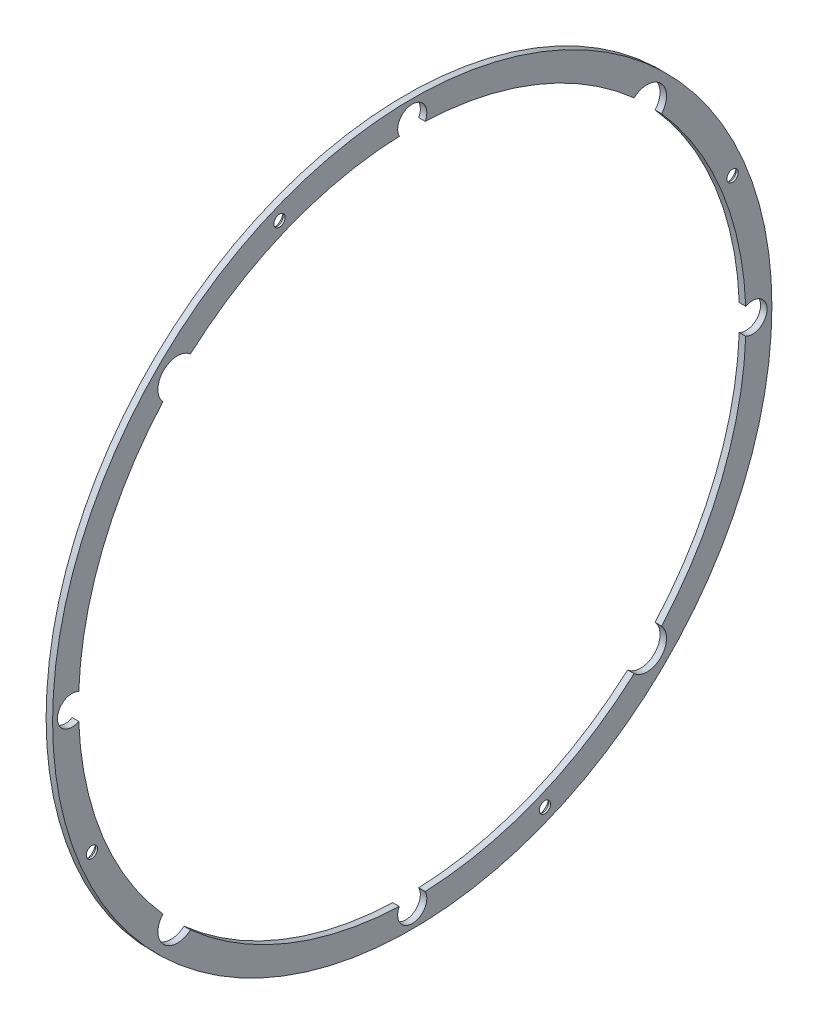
ISO-10303-21;
HEADER;
FILE_DESCRIPTION(('STEP AP214'),'2;1');
FILE_NAME('part.step','',(''),(''),'','','');
FILE_SCHEMA(('AUTOMOTIVE_DESIGN { 1 0 10303 214 1 1 1 1 }'));
ENDSEC;
DATA;
#1=APPLICATION_CONTEXT('core data for automotive mechanical design processes');
#2=APPLICATION_PROTOCOL_DEFINITION('international standard','automotive_design',2000,#1);
#3=PRODUCT_CONTEXT('',#1,'mechanical');
#4=PRODUCT('Part','Part','',(#3));
#5=PRODUCT_RELATED_PRODUCT_CATEGORY('part','',(#4));
#6=PRODUCT_DEFINITION_FORMATION('','',#4);
#7=PRODUCT_DEFINITION_CONTEXT('part definition',#1,'design');
#8=PRODUCT_DEFINITION('design','',#6,#7);
#9=PRODUCT_DEFINITION_SHAPE('','',#8);
#10=(LENGTH_UNIT() NAMED_UNIT(*) SI_UNIT(.MILLI.,.METRE.));
#11=(NAMED_UNIT(*) PLANE_ANGLE_UNIT() SI_UNIT($,.RADIAN.));
#12=(NAMED_UNIT(*) SI_UNIT($,.STERADIAN.) SOLID_ANGLE_UNIT());
#13=UNCERTAINTY_MEASURE_WITH_UNIT(LENGTH_MEASURE(1.E-05),#10,'distance_accuracy_value','');
#14=(GEOMETRIC_REPRESENTATION_CONTEXT(3) GLOBAL_UNCERTAINTY_ASSIGNED_CONTEXT((#13)) GLOBAL_UNIT_ASSIGNED_CONTEXT((#10,
#11,#12)) REPRESENTATION_CONTEXT('',''));
#15=CARTESIAN_POINT('',(0.,0.,0.));
#16=DIRECTION('',(0.,0.,1.));
#17=DIRECTION('',(1.,0.,0.));
#18=AXIS2_PLACEMENT_3D('',#15,#16,#17);
#19=CARTESIAN_POINT('',(0.,0.,0.));
#20=DIRECTION('',(1.,0.,0.));
#21=DIRECTION('',(0.,0.,-1.));
#22=AXIS2_PLACEMENT_3D('',#19,#20,#21);
#23=PLANE('',#22);
#24=CARTESIAN_POINT('',(0.,40.9471272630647,-98.8551099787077));
#25=DIRECTION('',(-1.,0.,0.));
#26=DIRECTION('',(0.,0.,1.));
#27=AXIS2_PLACEMENT_3D('',#24,#25,#26);
#28=CIRCLE('',#27,3.1);
#29=CARTESIAN_POINT('',(0.,40.9471272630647,-95.7551099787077));
#30=VERTEX_POINT('',#29);
#31=EDGE_CURVE('E289',#30,#30,#28,.T.);
#32=ORIENTED_EDGE('',*,*,#31,.F.);
#33=EDGE_LOOP('',(#32));
#34=FACE_BOUND('',#33,.T.);
#35=CARTESIAN_POINT('',(0.,0.,0.));
#36=DIRECTION('',(1.,0.,0.));
#37=DIRECTION('',(0.,0.,-1.));
#38=AXIS2_PLACEMENT_3D('',#35,#36,#37);
#39=CIRCLE('',#38,103.);
#40=CARTESIAN_POINT('',(0.,-102.922619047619,-3.99180264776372));
#41=VERTEX_POINT('',#40);
#42=CARTESIAN_POINT('',(0.,-76.9450746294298,-68.4722972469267));
#43=VERTEX_POINT('',#42);
#44=EDGE_CURVE('E186',#41,#43,#39,.T.);
#45=ORIENTED_EDGE('',*,*,#44,.T.);
#46=CARTESIAN_POINT('',(0.,-72.4784450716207,-72.4784450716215));
#47=DIRECTION('',(-1.,0.,0.));
#48=DIRECTION('',(0.,1.,0.));
#49=AXIS2_PLACEMENT_3D('',#46,#47,#48);
#50=CIRCLE('',#49,6.);
#51=CARTESIAN_POINT('',(0.,-68.4722972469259,-76.9450746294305));
#52=VERTEX_POINT('',#51);
#53=EDGE_CURVE('E154',#52,#43,#50,.T.);
#54=ORIENTED_EDGE('',*,*,#53,.F.);
#55=CARTESIAN_POINT('',(0.,-3.99180264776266,-102.922619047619));
#56=VERTEX_POINT('',#55);
#57=EDGE_CURVE('E162',#52,#56,#39,.T.);
#58=ORIENTED_EDGE('',*,*,#57,.T.);
#59=CARTESIAN_POINT('',(0.,0.,-105.));
#60=DIRECTION('',(-1.,0.,0.));
#61=DIRECTION('',(0.,0.,1.));
#62=AXIS2_PLACEMENT_3D('',#59,#60,#61);
#63=CIRCLE('',#62,4.5);
#64=CARTESIAN_POINT('',(0.,3.99180264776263,-102.922619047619));
#65=VERTEX_POINT('',#64);
#66=EDGE_CURVE('E176',#65,#56,#63,.T.);
#67=ORIENTED_EDGE('',*,*,#66,.F.);
#68=CARTESIAN_POINT('',(0.,68.4722972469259,-76.9450746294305));
#69=VERTEX_POINT('',#68);
#70=EDGE_CURVE('E188',#65,#69,#39,.T.);
#71=ORIENTED_EDGE('',*,*,#70,.T.);
#72=CARTESIAN_POINT('',(0.,72.4784450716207,-72.4784450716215));
#73=DIRECTION('',(-1.,0.,0.));
#74=DIRECTION('',(0.,0.,1.));
#75=AXIS2_PLACEMENT_3D('',#72,#73,#74);
#76=CIRCLE('',#75,6.);
#77=CARTESIAN_POINT('',(0.,76.9450746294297,-68.4722972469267));
#78=VERTEX_POINT('',#77);
#79=EDGE_CURVE('E226',#78,#69,#76,.T.);
#80=ORIENTED_EDGE('',*,*,#79,.F.);
#81=CARTESIAN_POINT('',(0.,102.922619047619,-3.9918026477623));
#82=VERTEX_POINT('',#81);
#83=EDGE_CURVE('E259',#78,#82,#39,.T.);
#84=ORIENTED_EDGE('',*,*,#83,.T.);
#85=CARTESIAN_POINT('',(0.,105.,3.53746749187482E-13));
#86=DIRECTION('',(-1.,0.,0.));
#87=DIRECTION('',(0.,-1.,0.));
#88=AXIS2_PLACEMENT_3D('',#85,#86,#87);
#89=CIRCLE('',#88,4.5);
#90=CARTESIAN_POINT('',(0.,102.922619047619,3.99180264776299));
#91=VERTEX_POINT('',#90);
#92=EDGE_CURVE('E250',#91,#82,#89,.T.);
#93=ORIENTED_EDGE('',*,*,#92,.F.);
#94=CARTESIAN_POINT('',(0.,76.9450746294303,68.4722972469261));
#95=VERTEX_POINT('',#94);
#96=EDGE_CURVE('E260',#91,#95,#39,.T.);
#97=ORIENTED_EDGE('',*,*,#96,.T.);
#98=CARTESIAN_POINT('',(0.,72.4784450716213,72.478445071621));
#99=DIRECTION('',(-1.,0.,0.));
#100=DIRECTION('',(0.,-1.,0.));
#101=AXIS2_PLACEMENT_3D('',#98,#99,#100);
#102=CIRCLE('',#101,6.);
#103=CARTESIAN_POINT('',(0.,68.4722972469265,76.94507462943));
#104=VERTEX_POINT('',#103);
#105=EDGE_CURVE('E216',#104,#95,#102,.T.);
#106=ORIENTED_EDGE('',*,*,#105,.F.);
#107=CARTESIAN_POINT('',(0.,3.99180264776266,102.922619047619));
#108=VERTEX_POINT('',#107);
#109=EDGE_CURVE('E267',#104,#108,#39,.T.);
#110=ORIENTED_EDGE('',*,*,#109,.T.);
#111=CARTESIAN_POINT('',(0.,0.,105.));
#112=DIRECTION('',(-1.,0.,0.));
#113=DIRECTION('',(0.,0.,-1.));
#114=AXIS2_PLACEMENT_3D('',#111,#112,#113);
#115=CIRCLE('',#114,4.5);
#116=CARTESIAN_POINT('',(0.,-3.99180264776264,102.922619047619));
#117=VERTEX_POINT('',#116);
#118=EDGE_CURVE('E242',#117,#108,#115,.T.);
#119=ORIENTED_EDGE('',*,*,#118,.F.);
#120=CARTESIAN_POINT('',(0.,-68.4722972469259,76.9450746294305));
#121=VERTEX_POINT('',#120);
#122=EDGE_CURVE('E269',#117,#121,#39,.T.);
#123=ORIENTED_EDGE('',*,*,#122,.T.);
#124=CARTESIAN_POINT('',(0.,-72.4784450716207,72.4784450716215));
#125=DIRECTION('',(-1.,0.,0.));
#126=DIRECTION('',(0.,0.,-1.));
#127=AXIS2_PLACEMENT_3D('',#124,#125,#126);
#128=CIRCLE('',#127,6.);
#129=CARTESIAN_POINT('',(0.,-76.9450746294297,68.4722972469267));
#130=VERTEX_POINT('',#129);
#131=EDGE_CURVE('E163',#130,#121,#128,.T.);
#132=ORIENTED_EDGE('',*,*,#131,.F.);
#133=CARTESIAN_POINT('',(0.,-102.922619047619,3.99180264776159));
#134=VERTEX_POINT('',#133);
#135=EDGE_CURVE('E187',#130,#134,#39,.T.);
#136=ORIENTED_EDGE('',*,*,#135,.T.);
#137=CARTESIAN_POINT('',(0.,-105.,-1.08695783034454E-12));
#138=DIRECTION('',(-1.,0.,0.));
#139=DIRECTION('',(0.,1.,0.));
#140=AXIS2_PLACEMENT_3D('',#137,#138,#139);
#141=CIRCLE('',#140,4.5);
#142=EDGE_CURVE('E230',#41,#134,#141,.T.);
#143=ORIENTED_EDGE('',*,*,#142,.F.);
#144=EDGE_LOOP('',(#45,#54,#58,#67,#71,#80,#84,#93,#97,#106,#110,#119,#123,#132,#136,#143));
#145=FACE_BOUND('',#144,.T.);
#146=CARTESIAN_POINT('',(0.,0.,0.));
#147=DIRECTION('',(-1.,0.,0.));
#148=DIRECTION('',(0.,0.,1.));
#149=AXIS2_PLACEMENT_3D('',#146,#147,#148);
#150=CIRCLE('',#149,111.);
#151=CARTESIAN_POINT('',(0.,0.,111.));
#152=VERTEX_POINT('',#151);
#153=EDGE_CURVE('E266',#152,#152,#150,.T.);
#154=ORIENTED_EDGE('',*,*,#153,.T.);
#155=EDGE_LOOP('',(#154));
#156=FACE_BOUND('',#155,.T.);
#157=CARTESIAN_POINT('',(0.,98.8551099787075,40.947127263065));
#158=DIRECTION('',(-1.,0.,0.));
#159=DIRECTION('',(0.,0.,1.));
#160=AXIS2_PLACEMENT_3D('',#157,#158,#159);
#161=CIRCLE('',#160,3.10000000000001);
#162=CARTESIAN_POINT('',(0.,98.8551099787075,44.047127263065));
#163=VERTEX_POINT('',#162);
#164=EDGE_CURVE('E298',#163,#163,#161,.T.);
#165=ORIENTED_EDGE('',*,*,#164,.F.);
#166=EDGE_LOOP('',(#165));
#167=FACE_BOUND('',#166,.T.);
#168=CARTESIAN_POINT('',(0.,-40.9471272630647,98.8551099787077));
#169=DIRECTION('',(-1.,0.,0.));
#170=DIRECTION('',(0.,0.,1.));
#171=AXIS2_PLACEMENT_3D('',#168,#169,#170);
#172=CIRCLE('',#171,3.1);
#173=CARTESIAN_POINT('',(0.,-40.9471272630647,101.955109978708));
#174=VERTEX_POINT('',#173);
#175=EDGE_CURVE('E307',#174,#174,#172,.T.);
#176=ORIENTED_EDGE('',*,*,#175,.F.);
#177=EDGE_LOOP('',(#176));
#178=FACE_BOUND('',#177,.T.);
#179=CARTESIAN_POINT('',(0.,-98.8551099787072,-40.9471272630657));
#180=DIRECTION('',(-1.,0.,0.));
#181=DIRECTION('',(0.,0.,1.));
#182=AXIS2_PLACEMENT_3D('',#179,#180,#181);
#183=CIRCLE('',#182,3.10000000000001);
#184=CARTESIAN_POINT('',(0.,-98.8551099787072,-37.8471272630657));
#185=VERTEX_POINT('',#184);
#186=EDGE_CURVE('E316',#185,#185,#183,.T.);
#187=ORIENTED_EDGE('',*,*,#186,.F.);
#188=EDGE_LOOP('',(#187));
#189=FACE_BOUND('',#188,.T.);
#190=ADVANCED_FACE('F36',(#34,#145,#156,#167,#178,#189),#23,.F.);
#191=CARTESIAN_POINT('',(0.,0.,0.));
#192=DIRECTION('',(1.,0.,0.));
#193=DIRECTION('',(0.,0.,-1.));
#194=AXIS2_PLACEMENT_3D('',#191,#192,#193);
#195=CYLINDRICAL_SURFACE('',#194,103.);
#196=ORIENTED_EDGE('',*,*,#57,.F.);
#197=DIRECTION('',(-1.,0.,0.));
#198=VECTOR('',#197,1.);
#199=CARTESIAN_POINT('',(1.,-68.4722972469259,-76.9450746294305));
#200=LINE('',#199,#198);
#201=CARTESIAN_POINT('',(2.00000000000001,-68.4722972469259,-76.9450746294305));
#202=VERTEX_POINT('',#201);
#203=EDGE_CURVE('E148',#52,#202,#200,.F.);
#204=ORIENTED_EDGE('',*,*,#203,.T.);
#205=CARTESIAN_POINT('',(2.00000000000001,0.,0.));
#206=DIRECTION('',(1.,0.,0.));
#207=DIRECTION('',(0.,0.,-1.));
#208=AXIS2_PLACEMENT_3D('',#205,#206,#207);
#209=CIRCLE('',#208,103.);
#210=CARTESIAN_POINT('',(2.00000000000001,-3.99180264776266,-102.922619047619));
#211=VERTEX_POINT('',#210);
#212=EDGE_CURVE('E160',#202,#211,#209,.T.);
#213=ORIENTED_EDGE('',*,*,#212,.T.);
#214=DIRECTION('',(-1.,0.,0.));
#215=VECTOR('',#214,1.);
#216=CARTESIAN_POINT('',(1.,-3.99180264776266,-102.922619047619));
#217=LINE('',#216,#215);
#218=EDGE_CURVE('E394',#211,#56,#217,.T.);
#219=ORIENTED_EDGE('',*,*,#218,.T.);
#220=EDGE_LOOP('',(#196,#204,#213,#219));
#221=FACE_BOUND('',#220,.T.);
#222=ADVANCED_FACE('F158',(#221),#195,.F.);
#223=ORIENTED_EDGE('',*,*,#135,.F.);
#224=DIRECTION('',(-1.,0.,0.));
#225=VECTOR('',#224,1.);
#226=CARTESIAN_POINT('',(1.,-76.9450746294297,68.4722972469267));
#227=LINE('',#226,#225);
#228=CARTESIAN_POINT('',(2.00000000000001,-76.9450746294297,68.4722972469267));
#229=VERTEX_POINT('',#228);
#230=EDGE_CURVE('E210',#130,#229,#227,.F.);
#231=ORIENTED_EDGE('',*,*,#230,.T.);
#232=CARTESIAN_POINT('',(2.00000000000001,-102.922619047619,3.99180264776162));
#233=VERTEX_POINT('',#232);
#234=EDGE_CURVE('E172',#229,#233,#209,.T.);
#235=ORIENTED_EDGE('',*,*,#234,.T.);
#236=DIRECTION('',(-1.,0.,0.));
#237=VECTOR('',#236,1.);
#238=CARTESIAN_POINT('',(1.,-102.922619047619,3.99180264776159));
#239=LINE('',#238,#237);
#240=EDGE_CURVE('E234',#233,#134,#239,.T.);
#241=ORIENTED_EDGE('',*,*,#240,.T.);
#242=EDGE_LOOP('',(#223,#231,#235,#241));
#243=FACE_BOUND('',#242,.T.);
#244=ADVANCED_FACE('F329',(#243),#195,.F.);
#245=ORIENTED_EDGE('',*,*,#109,.F.);
#246=DIRECTION('',(-1.,0.,0.));
#247=VECTOR('',#246,1.);
#248=CARTESIAN_POINT('',(1.,68.4722972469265,76.94507462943));
#249=LINE('',#248,#247);
#250=CARTESIAN_POINT('',(2.00000000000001,68.4722972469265,76.94507462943));
#251=VERTEX_POINT('',#250);
#252=EDGE_CURVE('E223',#104,#251,#249,.F.);
#253=ORIENTED_EDGE('',*,*,#252,.T.);
#254=CARTESIAN_POINT('',(2.00000000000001,3.99180264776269,102.922619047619));
#255=VERTEX_POINT('',#254);
#256=EDGE_CURVE('E180',#251,#255,#209,.T.);
#257=ORIENTED_EDGE('',*,*,#256,.T.);
#258=DIRECTION('',(-1.,0.,0.));
#259=VECTOR('',#258,1.);
#260=CARTESIAN_POINT('',(1.,3.99180264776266,102.922619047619));
#261=LINE('',#260,#259);
#262=EDGE_CURVE('E244',#255,#108,#261,.T.);
#263=ORIENTED_EDGE('',*,*,#262,.T.);
#264=EDGE_LOOP('',(#245,#253,#257,#263));
#265=FACE_BOUND('',#264,.T.);
#266=ADVANCED_FACE('F412',(#265),#195,.F.);
#267=ORIENTED_EDGE('',*,*,#83,.F.);
#268=DIRECTION('',(-1.,0.,0.));
#269=VECTOR('',#268,1.);
#270=CARTESIAN_POINT('',(1.,76.9450746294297,-68.4722972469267));
#271=LINE('',#270,#269);
#272=CARTESIAN_POINT('',(2.00000000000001,76.9450746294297,-68.4722972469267));
#273=VERTEX_POINT('',#272);
#274=EDGE_CURVE('E11',#78,#273,#271,.F.);
#275=ORIENTED_EDGE('',*,*,#274,.T.);
#276=CARTESIAN_POINT('',(2.00000000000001,102.922619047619,-3.9918026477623));
#277=VERTEX_POINT('',#276);
#278=EDGE_CURVE('E175',#273,#277,#209,.T.);
#279=ORIENTED_EDGE('',*,*,#278,.T.);
#280=DIRECTION('',(-1.,0.,0.));
#281=VECTOR('',#280,1.);
#282=CARTESIAN_POINT('',(1.,102.922619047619,-3.9918026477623));
#283=LINE('',#282,#281);
#284=EDGE_CURVE('E400',#277,#82,#283,.T.);
#285=ORIENTED_EDGE('',*,*,#284,.T.);
#286=EDGE_LOOP('',(#267,#275,#279,#285));
#287=FACE_BOUND('',#286,.T.);
#288=ADVANCED_FACE('F408',(#287),#195,.F.);
#289=CARTESIAN_POINT('',(2.00000000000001,-102.922619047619,-3.99180264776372));
#290=VERTEX_POINT('',#289);
#291=CARTESIAN_POINT('',(2.00000000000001,-76.9450746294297,-68.4722972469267));
#292=VERTEX_POINT('',#291);
#293=EDGE_CURVE('E170',#290,#292,#209,.T.);
#294=ORIENTED_EDGE('',*,*,#293,.T.);
#295=DIRECTION('',(-1.,0.,0.));
#296=VECTOR('',#295,1.);
#297=CARTESIAN_POINT('',(1.,-76.9450746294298,-68.4722972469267));
#298=LINE('',#297,#296);
#299=EDGE_CURVE('E50',#292,#43,#298,.T.);
#300=ORIENTED_EDGE('',*,*,#299,.T.);
#301=ORIENTED_EDGE('',*,*,#44,.F.);
#302=DIRECTION('',(-1.,0.,0.));
#303=VECTOR('',#302,1.);
#304=CARTESIAN_POINT('',(1.,-102.922619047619,-3.99180264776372));
#305=LINE('',#304,#303);
#306=EDGE_CURVE('E239',#41,#290,#305,.F.);
#307=ORIENTED_EDGE('',*,*,#306,.T.);
#308=EDGE_LOOP('',(#294,#300,#301,#307));
#309=FACE_BOUND('',#308,.T.);
#310=ADVANCED_FACE('F280',(#309),#195,.F.);
#311=CARTESIAN_POINT('',(2.00000000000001,-3.99180264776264,102.922619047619));
#312=VERTEX_POINT('',#311);
#313=CARTESIAN_POINT('',(2.00000000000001,-68.4722972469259,76.9450746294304));
#314=VERTEX_POINT('',#313);
#315=EDGE_CURVE('E174',#312,#314,#209,.T.);
#316=ORIENTED_EDGE('',*,*,#315,.T.);
#317=DIRECTION('',(-1.,0.,0.));
#318=VECTOR('',#317,1.);
#319=CARTESIAN_POINT('',(1.,-68.4722972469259,76.9450746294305));
#320=LINE('',#319,#318);
#321=EDGE_CURVE('E58',#314,#121,#320,.T.);
#322=ORIENTED_EDGE('',*,*,#321,.T.);
#323=ORIENTED_EDGE('',*,*,#122,.F.);
#324=DIRECTION('',(-1.,0.,0.));
#325=VECTOR('',#324,1.);
#326=CARTESIAN_POINT('',(1.,-3.99180264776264,102.922619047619));
#327=LINE('',#326,#325);
#328=EDGE_CURVE('E201',#117,#312,#327,.F.);
#329=ORIENTED_EDGE('',*,*,#328,.T.);
#330=EDGE_LOOP('',(#316,#322,#323,#329));
#331=FACE_BOUND('',#330,.T.);
#332=ADVANCED_FACE('F198',(#331),#195,.F.);
#333=CARTESIAN_POINT('',(2.00000000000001,102.922619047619,3.99180264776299));
#334=VERTEX_POINT('',#333);
#335=CARTESIAN_POINT('',(2.00000000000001,76.9450746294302,68.4722972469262));
#336=VERTEX_POINT('',#335);
#337=EDGE_CURVE('E182',#334,#336,#209,.T.);
#338=ORIENTED_EDGE('',*,*,#337,.T.);
#339=DIRECTION('',(-1.,0.,0.));
#340=VECTOR('',#339,1.);
#341=CARTESIAN_POINT('',(1.,76.9450746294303,68.4722972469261));
#342=LINE('',#341,#340);
#343=EDGE_CURVE('E220',#336,#95,#342,.T.);
#344=ORIENTED_EDGE('',*,*,#343,.T.);
#345=ORIENTED_EDGE('',*,*,#96,.F.);
#346=DIRECTION('',(-1.,0.,0.));
#347=VECTOR('',#346,1.);
#348=CARTESIAN_POINT('',(1.,102.922619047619,3.991802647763));
#349=LINE('',#348,#347);
#350=EDGE_CURVE('E403',#91,#334,#349,.F.);
#351=ORIENTED_EDGE('',*,*,#350,.T.);
#352=EDGE_LOOP('',(#338,#344,#345,#351));
#353=FACE_BOUND('',#352,.T.);
#354=ADVANCED_FACE('F381',(#353),#195,.F.);
#355=CARTESIAN_POINT('',(0.,0.,0.));
#356=DIRECTION('',(-1.,0.,0.));
#357=DIRECTION('',(0.,0.,1.));
#358=AXIS2_PLACEMENT_3D('',#355,#356,#357);
#359=CYLINDRICAL_SURFACE('',#358,111.);
#360=ORIENTED_EDGE('',*,*,#153,.F.);
#361=EDGE_LOOP('',(#360));
#362=FACE_BOUND('',#361,.T.);
#363=CARTESIAN_POINT('',(2.,0.,0.));
#364=DIRECTION('',(-1.,0.,0.));
#365=DIRECTION('',(0.,0.,1.));
#366=AXIS2_PLACEMENT_3D('',#363,#364,#365);
#367=CIRCLE('',#366,111.);
#368=CARTESIAN_POINT('',(2.,0.,111.));
#369=VERTEX_POINT('',#368);
#370=EDGE_CURVE('E258',#369,#369,#367,.T.);
#371=ORIENTED_EDGE('',*,*,#370,.T.);
#372=EDGE_LOOP('',(#371));
#373=FACE_BOUND('',#372,.T.);
#374=ADVANCED_FACE('F382',(#362,#373),#359,.T.);
#375=CARTESIAN_POINT('',(2.00000000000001,111.,0.));
#376=DIRECTION('',(-1.,0.,0.));
#377=DIRECTION('',(0.,0.,1.));
#378=AXIS2_PLACEMENT_3D('',#375,#376,#377);
#379=PLANE('',#378);
#380=CARTESIAN_POINT('',(2.00000000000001,-98.8551099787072,-40.9471272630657));
#381=DIRECTION('',(-1.,0.,0.));
#382=DIRECTION('',(0.,0.,1.));
#383=AXIS2_PLACEMENT_3D('',#380,#381,#382);
#384=CIRCLE('',#383,1.75);
#385=CARTESIAN_POINT('',(2.00000000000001,-98.8551099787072,-39.1971272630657));
#386=VERTEX_POINT('',#385);
#387=EDGE_CURVE('E310',#386,#386,#384,.T.);
#388=ORIENTED_EDGE('',*,*,#387,.T.);
#389=EDGE_LOOP('',(#388));
#390=FACE_BOUND('',#389,.T.);
#391=CARTESIAN_POINT('',(2.00000000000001,-40.9471272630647,98.8551099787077));
#392=DIRECTION('',(-1.,0.,0.));
#393=DIRECTION('',(0.,0.,1.));
#394=AXIS2_PLACEMENT_3D('',#391,#392,#393);
#395=CIRCLE('',#394,1.75);
#396=CARTESIAN_POINT('',(2.00000000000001,-40.9471272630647,100.605109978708));
#397=VERTEX_POINT('',#396);
#398=EDGE_CURVE('E301',#397,#397,#395,.T.);
#399=ORIENTED_EDGE('',*,*,#398,.T.);
#400=EDGE_LOOP('',(#399));
#401=FACE_BOUND('',#400,.T.);
#402=CARTESIAN_POINT('',(2.00000000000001,98.8551099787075,40.947127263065));
#403=DIRECTION('',(-1.,0.,0.));
#404=DIRECTION('',(0.,0.,1.));
#405=AXIS2_PLACEMENT_3D('',#402,#403,#404);
#406=CIRCLE('',#405,1.75);
#407=CARTESIAN_POINT('',(2.00000000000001,98.8551099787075,42.697127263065));
#408=VERTEX_POINT('',#407);
#409=EDGE_CURVE('E292',#408,#408,#406,.T.);
#410=ORIENTED_EDGE('',*,*,#409,.T.);
#411=EDGE_LOOP('',(#410));
#412=FACE_BOUND('',#411,.T.);
#413=CARTESIAN_POINT('',(2.00000000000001,40.9471272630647,-98.8551099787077));
#414=DIRECTION('',(-1.,0.,0.));
#415=DIRECTION('',(0.,0.,1.));
#416=AXIS2_PLACEMENT_3D('',#413,#414,#415);
#417=CIRCLE('',#416,1.75);
#418=CARTESIAN_POINT('',(2.00000000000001,40.9471272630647,-97.1051099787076));
#419=VERTEX_POINT('',#418);
#420=EDGE_CURVE('E282',#419,#419,#417,.T.);
#421=ORIENTED_EDGE('',*,*,#420,.T.);
#422=EDGE_LOOP('',(#421));
#423=FACE_BOUND('',#422,.T.);
#424=ORIENTED_EDGE('',*,*,#212,.F.);
#425=CARTESIAN_POINT('',(2.00000000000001,-72.4784450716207,-72.4784450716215));
#426=DIRECTION('',(-1.,0.,0.));
#427=DIRECTION('',(0.,1.,0.));
#428=AXIS2_PLACEMENT_3D('',#425,#426,#427);
#429=CIRCLE('',#428,6.);
#430=EDGE_CURVE('E145',#202,#292,#429,.T.);
#431=ORIENTED_EDGE('',*,*,#430,.T.);
#432=ORIENTED_EDGE('',*,*,#293,.F.);
#433=CARTESIAN_POINT('',(2.00000000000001,-105.,-1.08695783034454E-12));
#434=DIRECTION('',(-1.,0.,0.));
#435=DIRECTION('',(0.,1.,0.));
#436=AXIS2_PLACEMENT_3D('',#433,#434,#435);
#437=CIRCLE('',#436,4.5);
#438=EDGE_CURVE('E232',#290,#233,#437,.T.);
#439=ORIENTED_EDGE('',*,*,#438,.T.);
#440=ORIENTED_EDGE('',*,*,#234,.F.);
#441=CARTESIAN_POINT('',(2.00000000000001,-72.4784450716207,72.4784450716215));
#442=DIRECTION('',(-1.,0.,0.));
#443=DIRECTION('',(0.,0.,-1.));
#444=AXIS2_PLACEMENT_3D('',#441,#442,#443);
#445=CIRCLE('',#444,6.);
#446=EDGE_CURVE('E206',#229,#314,#445,.T.);
#447=ORIENTED_EDGE('',*,*,#446,.T.);
#448=ORIENTED_EDGE('',*,*,#315,.F.);
#449=CARTESIAN_POINT('',(2.00000000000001,0.,105.));
#450=DIRECTION('',(-1.,0.,0.));
#451=DIRECTION('',(0.,0.,-1.));
#452=AXIS2_PLACEMENT_3D('',#449,#450,#451);
#453=CIRCLE('',#452,4.5);
#454=EDGE_CURVE('E204',#312,#255,#453,.T.);
#455=ORIENTED_EDGE('',*,*,#454,.T.);
#456=ORIENTED_EDGE('',*,*,#256,.F.);
#457=CARTESIAN_POINT('',(2.00000000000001,72.4784450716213,72.478445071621));
#458=DIRECTION('',(-1.,0.,0.));
#459=DIRECTION('',(0.,-1.,0.));
#460=AXIS2_PLACEMENT_3D('',#457,#458,#459);
#461=CIRCLE('',#460,6.);
#462=EDGE_CURVE('E217',#251,#336,#461,.T.);
#463=ORIENTED_EDGE('',*,*,#462,.T.);
#464=ORIENTED_EDGE('',*,*,#337,.F.);
#465=CARTESIAN_POINT('',(2.00000000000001,105.,3.53746749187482E-13));
#466=DIRECTION('',(-1.,0.,0.));
#467=DIRECTION('',(0.,-1.,0.));
#468=AXIS2_PLACEMENT_3D('',#465,#466,#467);
#469=CIRCLE('',#468,4.5);
#470=EDGE_CURVE('E251',#334,#277,#469,.T.);
#471=ORIENTED_EDGE('',*,*,#470,.T.);
#472=ORIENTED_EDGE('',*,*,#278,.F.);
#473=CARTESIAN_POINT('',(2.00000000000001,72.4784450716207,-72.4784450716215));
#474=DIRECTION('',(-1.,0.,0.));
#475=DIRECTION('',(0.,0.,1.));
#476=AXIS2_PLACEMENT_3D('',#473,#474,#475);
#477=CIRCLE('',#476,6.);
#478=CARTESIAN_POINT('',(2.00000000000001,68.4722972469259,-76.9450746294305));
#479=VERTEX_POINT('',#478);
#480=EDGE_CURVE('E227',#273,#479,#477,.T.);
#481=ORIENTED_EDGE('',*,*,#480,.T.);
#482=CARTESIAN_POINT('',(2.00000000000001,3.99180264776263,-102.922619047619));
#483=VERTEX_POINT('',#482);
#484=EDGE_CURVE('E173',#483,#479,#209,.T.);
#485=ORIENTED_EDGE('',*,*,#484,.F.);
#486=CARTESIAN_POINT('',(2.00000000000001,0.,-105.));
#487=DIRECTION('',(-1.,0.,0.));
#488=DIRECTION('',(0.,0.,1.));
#489=AXIS2_PLACEMENT_3D('',#486,#487,#488);
#490=CIRCLE('',#489,4.5);
#491=EDGE_CURVE('E169',#483,#211,#490,.T.);
#492=ORIENTED_EDGE('',*,*,#491,.T.);
#493=EDGE_LOOP('',(#424,#431,#432,#439,#440,#447,#448,#455,#456,#463,#464,#471,#472,#481,#485,#492));
#494=FACE_BOUND('',#493,.T.);
#495=ORIENTED_EDGE('',*,*,#370,.F.);
#496=EDGE_LOOP('',(#495));
#497=FACE_BOUND('',#496,.T.);
#498=ADVANCED_FACE('F166',(#390,#401,#412,#423,#494,#497),#379,.F.);
#499=ORIENTED_EDGE('',*,*,#484,.T.);
#500=DIRECTION('',(-1.,0.,0.));
#501=VECTOR('',#500,1.);
#502=CARTESIAN_POINT('',(1.,68.4722972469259,-76.9450746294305));
#503=LINE('',#502,#501);
#504=EDGE_CURVE('E43',#479,#69,#503,.T.);
#505=ORIENTED_EDGE('',*,*,#504,.T.);
#506=ORIENTED_EDGE('',*,*,#70,.F.);
#507=DIRECTION('',(-1.,0.,0.));
#508=VECTOR('',#507,1.);
#509=CARTESIAN_POINT('',(1.,3.99180264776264,-102.922619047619));
#510=LINE('',#509,#508);
#511=EDGE_CURVE('E396',#65,#483,#510,.F.);
#512=ORIENTED_EDGE('',*,*,#511,.T.);
#513=EDGE_LOOP('',(#499,#505,#506,#512));
#514=FACE_BOUND('',#513,.T.);
#515=ADVANCED_FACE('F331',(#514),#195,.F.);
#516=CARTESIAN_POINT('',(2.00000000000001,0.,-105.));
#517=DIRECTION('',(-1.,0.,0.));
#518=DIRECTION('',(0.,0.,1.));
#519=AXIS2_PLACEMENT_3D('',#516,#517,#518);
#520=CYLINDRICAL_SURFACE('',#519,4.5);
#521=ORIENTED_EDGE('',*,*,#66,.T.);
#522=ORIENTED_EDGE('',*,*,#218,.F.);
#523=ORIENTED_EDGE('',*,*,#491,.F.);
#524=ORIENTED_EDGE('',*,*,#511,.F.);
#525=EDGE_LOOP('',(#521,#522,#523,#524));
#526=FACE_BOUND('',#525,.T.);
#527=ADVANCED_FACE('F375',(#526),#520,.F.);
#528=CARTESIAN_POINT('',(2.00000000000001,105.,3.53746749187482E-13));
#529=DIRECTION('',(-1.,0.,0.));
#530=DIRECTION('',(0.,0.,1.));
#531=AXIS2_PLACEMENT_3D('',#528,#529,#530);
#532=CYLINDRICAL_SURFACE('',#531,4.5);
#533=ORIENTED_EDGE('',*,*,#92,.T.);
#534=ORIENTED_EDGE('',*,*,#284,.F.);
#535=ORIENTED_EDGE('',*,*,#470,.F.);
#536=ORIENTED_EDGE('',*,*,#350,.F.);
#537=EDGE_LOOP('',(#533,#534,#535,#536));
#538=FACE_BOUND('',#537,.T.);
#539=ADVANCED_FACE('F371',(#538),#532,.F.);
#540=CARTESIAN_POINT('',(2.00000000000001,0.,105.));
#541=DIRECTION('',(-1.,0.,0.));
#542=DIRECTION('',(0.,0.,1.));
#543=AXIS2_PLACEMENT_3D('',#540,#541,#542);
#544=CYLINDRICAL_SURFACE('',#543,4.5);
#545=ORIENTED_EDGE('',*,*,#118,.T.);
#546=ORIENTED_EDGE('',*,*,#262,.F.);
#547=ORIENTED_EDGE('',*,*,#454,.F.);
#548=ORIENTED_EDGE('',*,*,#328,.F.);
#549=EDGE_LOOP('',(#545,#546,#547,#548));
#550=FACE_BOUND('',#549,.T.);
#551=ADVANCED_FACE('F367',(#550),#544,.F.);
#552=CARTESIAN_POINT('',(2.00000000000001,-105.,-1.08695783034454E-12));
#553=DIRECTION('',(-1.,0.,0.));
#554=DIRECTION('',(0.,0.,1.));
#555=AXIS2_PLACEMENT_3D('',#552,#553,#554);
#556=CYLINDRICAL_SURFACE('',#555,4.5);
#557=ORIENTED_EDGE('',*,*,#142,.T.);
#558=ORIENTED_EDGE('',*,*,#240,.F.);
#559=ORIENTED_EDGE('',*,*,#438,.F.);
#560=ORIENTED_EDGE('',*,*,#306,.F.);
#561=EDGE_LOOP('',(#557,#558,#559,#560));
#562=FACE_BOUND('',#561,.T.);
#563=ADVANCED_FACE('F363',(#562),#556,.F.);
#564=CARTESIAN_POINT('',(2.00000000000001,72.4784450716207,-72.4784450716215));
#565=DIRECTION('',(-1.,0.,0.));
#566=DIRECTION('',(0.,0.,1.));
#567=AXIS2_PLACEMENT_3D('',#564,#565,#566);
#568=CYLINDRICAL_SURFACE('',#567,6.);
#569=ORIENTED_EDGE('',*,*,#79,.T.);
#570=ORIENTED_EDGE('',*,*,#504,.F.);
#571=ORIENTED_EDGE('',*,*,#480,.F.);
#572=ORIENTED_EDGE('',*,*,#274,.F.);
#573=EDGE_LOOP('',(#569,#570,#571,#572));
#574=FACE_BOUND('',#573,.T.);
#575=ADVANCED_FACE('F359',(#574),#568,.F.);
#576=CARTESIAN_POINT('',(2.00000000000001,72.4784450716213,72.478445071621));
#577=DIRECTION('',(-1.,0.,0.));
#578=DIRECTION('',(0.,0.,1.));
#579=AXIS2_PLACEMENT_3D('',#576,#577,#578);
#580=CYLINDRICAL_SURFACE('',#579,6.);
#581=ORIENTED_EDGE('',*,*,#105,.T.);
#582=ORIENTED_EDGE('',*,*,#343,.F.);
#583=ORIENTED_EDGE('',*,*,#462,.F.);
#584=ORIENTED_EDGE('',*,*,#252,.F.);
#585=EDGE_LOOP('',(#581,#582,#583,#584));
#586=FACE_BOUND('',#585,.T.);
#587=ADVANCED_FACE('F356',(#586),#580,.F.);
#588=CARTESIAN_POINT('',(2.00000000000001,-72.4784450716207,72.4784450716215));
#589=DIRECTION('',(-1.,0.,0.));
#590=DIRECTION('',(0.,0.,1.));
#591=AXIS2_PLACEMENT_3D('',#588,#589,#590);
#592=CYLINDRICAL_SURFACE('',#591,6.);
#593=ORIENTED_EDGE('',*,*,#131,.T.);
#594=ORIENTED_EDGE('',*,*,#321,.F.);
#595=ORIENTED_EDGE('',*,*,#446,.F.);
#596=ORIENTED_EDGE('',*,*,#230,.F.);
#597=EDGE_LOOP('',(#593,#594,#595,#596));
#598=FACE_BOUND('',#597,.T.);
#599=ADVANCED_FACE('F353',(#598),#592,.F.);
#600=CARTESIAN_POINT('',(2.00000000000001,-72.4784450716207,-72.4784450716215));
#601=DIRECTION('',(-1.,0.,0.));
#602=DIRECTION('',(0.,0.,1.));
#603=AXIS2_PLACEMENT_3D('',#600,#601,#602);
#604=CYLINDRICAL_SURFACE('',#603,6.);
#605=ORIENTED_EDGE('',*,*,#53,.T.);
#606=ORIENTED_EDGE('',*,*,#299,.F.);
#607=ORIENTED_EDGE('',*,*,#430,.F.);
#608=ORIENTED_EDGE('',*,*,#203,.F.);
#609=EDGE_LOOP('',(#605,#606,#607,#608));
#610=FACE_BOUND('',#609,.T.);
#611=ADVANCED_FACE('F147',(#610),#604,.F.);
#612=CARTESIAN_POINT('',(0.,40.9471272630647,-98.8551099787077));
#613=DIRECTION('',(-1.,0.,0.));
#614=DIRECTION('',(0.,0.,1.));
#615=AXIS2_PLACEMENT_3D('',#612,#613,#614);
#616=CYLINDRICAL_SURFACE('',#615,1.75);
#617=ORIENTED_EDGE('',*,*,#420,.F.);
#618=EDGE_LOOP('',(#617));
#619=FACE_BOUND('',#618,.T.);
#620=CARTESIAN_POINT('',(1.35,40.9471272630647,-98.8551099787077));
#621=DIRECTION('',(-1.,0.,0.));
#622=DIRECTION('',(0.,0.,1.));
#623=AXIS2_PLACEMENT_3D('',#620,#621,#622);
#624=CIRCLE('',#623,1.75);
#625=CARTESIAN_POINT('',(1.35,40.9471272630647,-97.1051099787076));
#626=VERTEX_POINT('',#625);
#627=EDGE_CURVE('E286',#626,#626,#624,.T.);
#628=ORIENTED_EDGE('',*,*,#627,.T.);
#629=EDGE_LOOP('',(#628));
#630=FACE_BOUND('',#629,.T.);
#631=ADVANCED_FACE('F337',(#619,#630),#616,.F.);
#632=CARTESIAN_POINT('',(0.,40.9471272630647,-98.8551099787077));
#633=DIRECTION('',(-1.,0.,0.));
#634=DIRECTION('',(0.,0.,1.));
#635=AXIS2_PLACEMENT_3D('',#632,#633,#634);
#636=CONICAL_SURFACE('',#635,3.1,0.785398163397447);
#637=ORIENTED_EDGE('',*,*,#627,.F.);
#638=EDGE_LOOP('',(#637));
#639=FACE_BOUND('',#638,.T.);
#640=ORIENTED_EDGE('',*,*,#31,.T.);
#641=EDGE_LOOP('',(#640));
#642=FACE_BOUND('',#641,.T.);
#643=ADVANCED_FACE('F334',(#639,#642),#636,.F.);
#644=CARTESIAN_POINT('',(0.,98.8551099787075,40.947127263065));
#645=DIRECTION('',(-1.,0.,0.));
#646=DIRECTION('',(0.,0.,1.));
#647=AXIS2_PLACEMENT_3D('',#644,#645,#646);
#648=CYLINDRICAL_SURFACE('',#647,1.75);
#649=ORIENTED_EDGE('',*,*,#409,.F.);
#650=EDGE_LOOP('',(#649));
#651=FACE_BOUND('',#650,.T.);
#652=CARTESIAN_POINT('',(1.35,98.8551099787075,40.947127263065));
#653=DIRECTION('',(-1.,0.,0.));
#654=DIRECTION('',(0.,0.,1.));
#655=AXIS2_PLACEMENT_3D('',#652,#653,#654);
#656=CIRCLE('',#655,1.75);
#657=CARTESIAN_POINT('',(1.35,98.8551099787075,42.697127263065));
#658=VERTEX_POINT('',#657);
#659=EDGE_CURVE('E295',#658,#658,#656,.T.);
#660=ORIENTED_EDGE('',*,*,#659,.T.);
#661=EDGE_LOOP('',(#660));
#662=FACE_BOUND('',#661,.T.);
#663=ADVANCED_FACE('F336',(#651,#662),#648,.F.);
#664=CARTESIAN_POINT('',(0.,98.8551099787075,40.947127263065));
#665=DIRECTION('',(-1.,0.,0.));
#666=DIRECTION('',(0.,0.,1.));
#667=AXIS2_PLACEMENT_3D('',#664,#665,#666);
#668=CONICAL_SURFACE('',#667,3.10000000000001,0.78539816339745);
#669=ORIENTED_EDGE('',*,*,#659,.F.);
#670=EDGE_LOOP('',(#669));
#671=FACE_BOUND('',#670,.T.);
#672=ORIENTED_EDGE('',*,*,#164,.T.);
#673=EDGE_LOOP('',(#672));
#674=FACE_BOUND('',#673,.T.);
#675=ADVANCED_FACE('F343',(#671,#674),#668,.F.);
#676=CARTESIAN_POINT('',(0.,-40.9471272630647,98.8551099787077));
#677=DIRECTION('',(-1.,0.,0.));
#678=DIRECTION('',(0.,0.,1.));
#679=AXIS2_PLACEMENT_3D('',#676,#677,#678);
#680=CYLINDRICAL_SURFACE('',#679,1.75);
#681=ORIENTED_EDGE('',*,*,#398,.F.);
#682=EDGE_LOOP('',(#681));
#683=FACE_BOUND('',#682,.T.);
#684=CARTESIAN_POINT('',(1.35,-40.9471272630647,98.8551099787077));
#685=DIRECTION('',(-1.,0.,0.));
#686=DIRECTION('',(0.,0.,1.));
#687=AXIS2_PLACEMENT_3D('',#684,#685,#686);
#688=CIRCLE('',#687,1.75);
#689=CARTESIAN_POINT('',(1.35,-40.9471272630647,100.605109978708));
#690=VERTEX_POINT('',#689);
#691=EDGE_CURVE('E304',#690,#690,#688,.T.);
#692=ORIENTED_EDGE('',*,*,#691,.T.);
#693=EDGE_LOOP('',(#692));
#694=FACE_BOUND('',#693,.T.);
#695=ADVANCED_FACE('F498',(#683,#694),#680,.F.);
#696=CARTESIAN_POINT('',(0.,-40.9471272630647,98.8551099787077));
#697=DIRECTION('',(-1.,0.,0.));
#698=DIRECTION('',(0.,0.,1.));
#699=AXIS2_PLACEMENT_3D('',#696,#697,#698);
#700=CONICAL_SURFACE('',#699,3.1,0.785398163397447);
#701=ORIENTED_EDGE('',*,*,#691,.F.);
#702=EDGE_LOOP('',(#701));
#703=FACE_BOUND('',#702,.T.);
#704=ORIENTED_EDGE('',*,*,#175,.T.);
#705=EDGE_LOOP('',(#704));
#706=FACE_BOUND('',#705,.T.);
#707=ADVANCED_FACE('F507',(#703,#706),#700,.F.);
#708=CARTESIAN_POINT('',(0.,-98.8551099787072,-40.9471272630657));
#709=DIRECTION('',(-1.,0.,0.));
#710=DIRECTION('',(0.,0.,1.));
#711=AXIS2_PLACEMENT_3D('',#708,#709,#710);
#712=CYLINDRICAL_SURFACE('',#711,1.75);
#713=ORIENTED_EDGE('',*,*,#387,.F.);
#714=EDGE_LOOP('',(#713));
#715=FACE_BOUND('',#714,.T.);
#716=CARTESIAN_POINT('',(1.35,-98.8551099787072,-40.9471272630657));
#717=DIRECTION('',(-1.,0.,0.));
#718=DIRECTION('',(0.,0.,1.));
#719=AXIS2_PLACEMENT_3D('',#716,#717,#718);
#720=CIRCLE('',#719,1.75);
#721=CARTESIAN_POINT('',(1.35,-98.8551099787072,-39.1971272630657));
#722=VERTEX_POINT('',#721);
#723=EDGE_CURVE('E313',#722,#722,#720,.T.);
#724=ORIENTED_EDGE('',*,*,#723,.T.);
#725=EDGE_LOOP('',(#724));
#726=FACE_BOUND('',#725,.T.);
#727=ADVANCED_FACE('F517',(#715,#726),#712,.F.);
#728=CARTESIAN_POINT('',(0.,-98.8551099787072,-40.9471272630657));
#729=DIRECTION('',(-1.,0.,0.));
#730=DIRECTION('',(0.,0.,1.));
#731=AXIS2_PLACEMENT_3D('',#728,#729,#730);
#732=CONICAL_SURFACE('',#731,3.10000000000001,0.78539816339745);
#733=ORIENTED_EDGE('',*,*,#723,.F.);
#734=EDGE_LOOP('',(#733));
#735=FACE_BOUND('',#734,.T.);
#736=ORIENTED_EDGE('',*,*,#186,.T.);
#737=EDGE_LOOP('',(#736));
#738=FACE_BOUND('',#737,.T.);
#739=ADVANCED_FACE('F320',(#735,#738),#732,.F.);
#740=CLOSED_SHELL('',(#190,#222,#244,#266,#288,#310,#332,#354,#374,#498,#515,#527,#539,#551,
#563,#575,#587,#599,#611,#631,#643,#663,#675,#695,#707,#727,#739));
#741=MANIFOLD_SOLID_BREP('B2',#740);
#742=ADVANCED_BREP_SHAPE_REPRESENTATION('',(#18,#741),#14);
#743=SHAPE_DEFINITION_REPRESENTATION(#9,#742);
ENDSEC;
END-ISO-10303-21;
